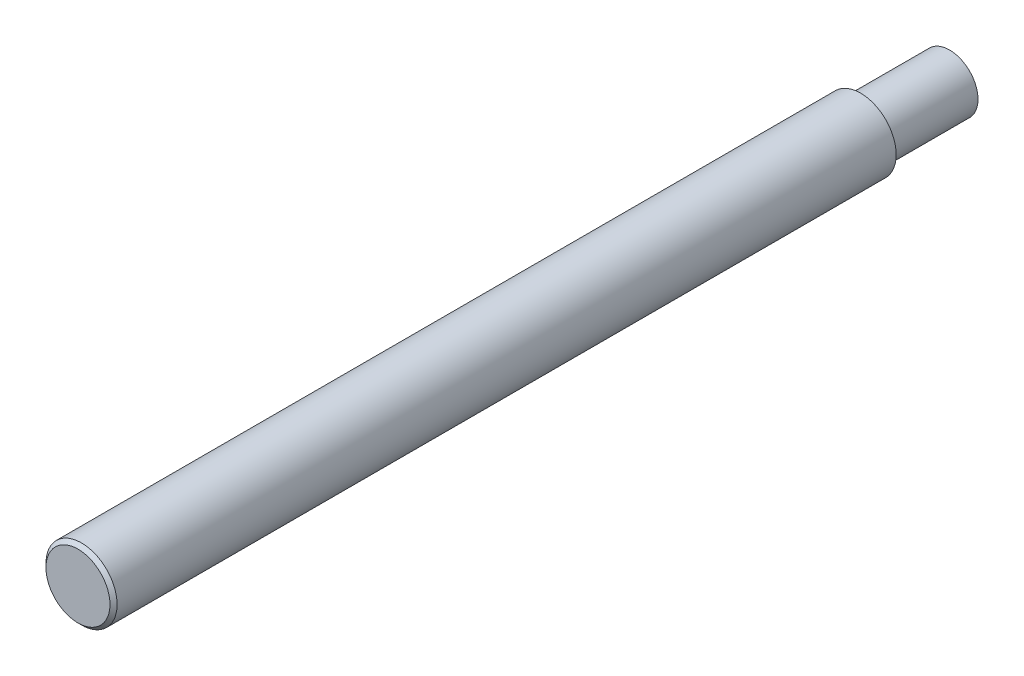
ISO-10303-21;
HEADER;
FILE_DESCRIPTION(('STEP AP214'),'2;1');
FILE_NAME('part.step','',(''),(''),'','','');
FILE_SCHEMA(('AUTOMOTIVE_DESIGN { 1 0 10303 214 1 1 1 1 }'));
ENDSEC;
DATA;
#1=APPLICATION_CONTEXT('core data for automotive mechanical design processes');
#2=APPLICATION_PROTOCOL_DEFINITION('international standard','automotive_design',2000,#1);
#3=PRODUCT_CONTEXT('',#1,'mechanical');
#4=PRODUCT('Part','Part','',(#3));
#5=PRODUCT_RELATED_PRODUCT_CATEGORY('part','',(#4));
#6=PRODUCT_DEFINITION_FORMATION('','',#4);
#7=PRODUCT_DEFINITION_CONTEXT('part definition',#1,'design');
#8=PRODUCT_DEFINITION('design','',#6,#7);
#9=PRODUCT_DEFINITION_SHAPE('','',#8);
#10=(LENGTH_UNIT() NAMED_UNIT(*) SI_UNIT(.MILLI.,.METRE.));
#11=(NAMED_UNIT(*) PLANE_ANGLE_UNIT() SI_UNIT($,.RADIAN.));
#12=(NAMED_UNIT(*) SI_UNIT($,.STERADIAN.) SOLID_ANGLE_UNIT());
#13=UNCERTAINTY_MEASURE_WITH_UNIT(LENGTH_MEASURE(1.E-05),#10,'distance_accuracy_value','');
#14=(GEOMETRIC_REPRESENTATION_CONTEXT(3) GLOBAL_UNCERTAINTY_ASSIGNED_CONTEXT((#13)) GLOBAL_UNIT_ASSIGNED_CONTEXT((#10,
#11,#12)) REPRESENTATION_CONTEXT('',''));
#15=CARTESIAN_POINT('',(0.,0.,0.));
#16=DIRECTION('',(0.,0.,1.));
#17=DIRECTION('',(1.,0.,0.));
#18=AXIS2_PLACEMENT_3D('',#15,#16,#17);
#19=CARTESIAN_POINT('',(0.,0.,220.));
#20=DIRECTION('',(0.,0.,-1.));
#21=DIRECTION('',(-1.,0.,0.));
#22=AXIS2_PLACEMENT_3D('',#19,#20,#21);
#23=CYLINDRICAL_SURFACE('',#22,10.);
#24=CARTESIAN_POINT('',(0.,0.,219.));
#25=DIRECTION('',(0.,0.,1.));
#26=DIRECTION('',(1.,0.,0.));
#27=AXIS2_PLACEMENT_3D('',#24,#25,#26);
#28=CIRCLE('',#27,10.);
#29=CARTESIAN_POINT('',(10.,0.,219.));
#30=VERTEX_POINT('',#29);
#31=EDGE_CURVE('E10',#30,#30,#28,.F.);
#32=ORIENTED_EDGE('',*,*,#31,.T.);
#33=EDGE_LOOP('',(#32));
#34=FACE_BOUND('',#33,.T.);
#35=CARTESIAN_POINT('',(0.,0.,0.));
#36=DIRECTION('',(0.,0.,1.));
#37=DIRECTION('',(1.,0.,0.));
#38=AXIS2_PLACEMENT_3D('',#35,#36,#37);
#39=CIRCLE('',#38,10.);
#40=CARTESIAN_POINT('',(10.,0.,0.));
#41=VERTEX_POINT('',#40);
#42=EDGE_CURVE('E52',#41,#41,#39,.T.);
#43=ORIENTED_EDGE('',*,*,#42,.T.);
#44=EDGE_LOOP('',(#43));
#45=FACE_BOUND('',#44,.T.);
#46=ADVANCED_FACE('F37',(#34,#45),#23,.T.);
#47=CARTESIAN_POINT('',(0.,0.,220.));
#48=DIRECTION('',(0.,0.,1.));
#49=DIRECTION('',(1.,0.,0.));
#50=AXIS2_PLACEMENT_3D('',#47,#48,#49);
#51=PLANE('',#50);
#52=CARTESIAN_POINT('',(0.,0.,220.));
#53=DIRECTION('',(0.,0.,1.));
#54=DIRECTION('',(1.,0.,0.));
#55=AXIS2_PLACEMENT_3D('',#52,#53,#54);
#56=CIRCLE('',#55,9.00000000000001);
#57=CARTESIAN_POINT('',(9.00000000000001,0.,220.));
#58=VERTEX_POINT('',#57);
#59=EDGE_CURVE('E44',#58,#58,#56,.T.);
#60=ORIENTED_EDGE('',*,*,#59,.T.);
#61=EDGE_LOOP('',(#60));
#62=FACE_BOUND('',#61,.T.);
#63=ADVANCED_FACE('F72',(#62),#51,.T.);
#64=CARTESIAN_POINT('',(0.,0.,0.));
#65=DIRECTION('',(0.,0.,1.));
#66=DIRECTION('',(1.,0.,0.));
#67=AXIS2_PLACEMENT_3D('',#64,#65,#66);
#68=PLANE('',#67);
#69=CARTESIAN_POINT('',(0.,0.,0.));
#70=DIRECTION('',(0.,0.,1.));
#71=DIRECTION('',(1.,0.,0.));
#72=AXIS2_PLACEMENT_3D('',#69,#70,#71);
#73=CIRCLE('',#72,8.);
#74=CARTESIAN_POINT('',(8.,0.,0.));
#75=VERTEX_POINT('',#74);
#76=EDGE_CURVE('E48',#75,#75,#73,.F.);
#77=ORIENTED_EDGE('',*,*,#76,.F.);
#78=EDGE_LOOP('',(#77));
#79=FACE_BOUND('',#78,.T.);
#80=ORIENTED_EDGE('',*,*,#42,.F.);
#81=EDGE_LOOP('',(#80));
#82=FACE_BOUND('',#81,.T.);
#83=ADVANCED_FACE('F66',(#79,#82),#68,.F.);
#84=CARTESIAN_POINT('',(0.,0.,-25.));
#85=DIRECTION('',(0.,0.,1.));
#86=DIRECTION('',(1.,0.,0.));
#87=AXIS2_PLACEMENT_3D('',#84,#85,#86);
#88=CYLINDRICAL_SURFACE('',#87,8.);
#89=CARTESIAN_POINT('',(0.,0.,-25.));
#90=DIRECTION('',(0.,0.,-1.));
#91=DIRECTION('',(-1.,0.,0.));
#92=AXIS2_PLACEMENT_3D('',#89,#90,#91);
#93=CIRCLE('',#92,8.);
#94=CARTESIAN_POINT('',(-8.,0.,-25.));
#95=VERTEX_POINT('',#94);
#96=EDGE_CURVE('E57',#95,#95,#93,.T.);
#97=ORIENTED_EDGE('',*,*,#96,.F.);
#98=EDGE_LOOP('',(#97));
#99=FACE_BOUND('',#98,.T.);
#100=ORIENTED_EDGE('',*,*,#76,.T.);
#101=EDGE_LOOP('',(#100));
#102=FACE_BOUND('',#101,.T.);
#103=ADVANCED_FACE('F63',(#99,#102),#88,.T.);
#104=CARTESIAN_POINT('',(0.,0.,-25.));
#105=DIRECTION('',(0.,0.,-1.));
#106=DIRECTION('',(-1.,0.,0.));
#107=AXIS2_PLACEMENT_3D('',#104,#105,#106);
#108=PLANE('',#107);
#109=ORIENTED_EDGE('',*,*,#96,.T.);
#110=EDGE_LOOP('',(#109));
#111=FACE_BOUND('',#110,.T.);
#112=ADVANCED_FACE('F61',(#111),#108,.T.);
#113=CARTESIAN_POINT('',(0.,0.,220.));
#114=DIRECTION('',(0.,0.,-1.));
#115=DIRECTION('',(-1.,0.,0.));
#116=AXIS2_PLACEMENT_3D('',#113,#114,#115);
#117=CONICAL_SURFACE('',#116,9.00000000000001,0.785398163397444);
#118=ORIENTED_EDGE('',*,*,#31,.F.);
#119=EDGE_LOOP('',(#118));
#120=FACE_BOUND('',#119,.T.);
#121=ORIENTED_EDGE('',*,*,#59,.F.);
#122=EDGE_LOOP('',(#121));
#123=FACE_BOUND('',#122,.T.);
#124=ADVANCED_FACE('F39',(#120,#123),#117,.T.);
#125=CLOSED_SHELL('',(#46,#63,#83,#103,#112,#124));
#126=MANIFOLD_SOLID_BREP('B2',#125);
#127=ADVANCED_BREP_SHAPE_REPRESENTATION('',(#18,#126),#14);
#128=SHAPE_DEFINITION_REPRESENTATION(#9,#127);
ENDSEC;
END-ISO-10303-21;
